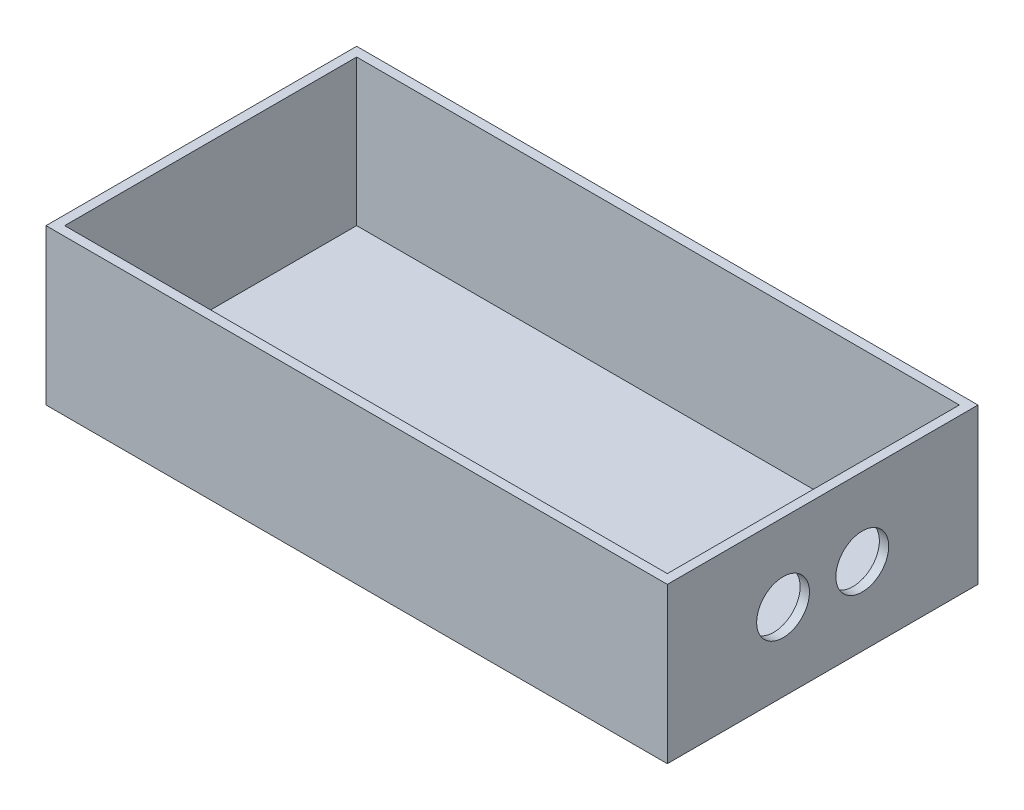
ISO-10303-21;
HEADER;
FILE_DESCRIPTION(('STEP AP214'),'2;1');
FILE_NAME('part.step','',(''),(''),'','','');
FILE_SCHEMA(('AUTOMOTIVE_DESIGN { 1 0 10303 214 1 1 1 1 }'));
ENDSEC;
DATA;
#1=APPLICATION_CONTEXT('core data for automotive mechanical design processes');
#2=APPLICATION_PROTOCOL_DEFINITION('international standard','automotive_design',2000,#1);
#3=PRODUCT_CONTEXT('',#1,'mechanical');
#4=PRODUCT('Part','Part','',(#3));
#5=PRODUCT_RELATED_PRODUCT_CATEGORY('part','',(#4));
#6=PRODUCT_DEFINITION_FORMATION('','',#4);
#7=PRODUCT_DEFINITION_CONTEXT('part definition',#1,'design');
#8=PRODUCT_DEFINITION('design','',#6,#7);
#9=PRODUCT_DEFINITION_SHAPE('','',#8);
#10=(LENGTH_UNIT() NAMED_UNIT(*) SI_UNIT(.MILLI.,.METRE.));
#11=(NAMED_UNIT(*) PLANE_ANGLE_UNIT() SI_UNIT($,.RADIAN.));
#12=(NAMED_UNIT(*) SI_UNIT($,.STERADIAN.) SOLID_ANGLE_UNIT());
#13=UNCERTAINTY_MEASURE_WITH_UNIT(LENGTH_MEASURE(1.E-05),#10,'distance_accuracy_value','');
#14=(GEOMETRIC_REPRESENTATION_CONTEXT(3) GLOBAL_UNCERTAINTY_ASSIGNED_CONTEXT((#13)) GLOBAL_UNIT_ASSIGNED_CONTEXT((#10,
#11,#12)) REPRESENTATION_CONTEXT('',''));
#15=CARTESIAN_POINT('',(0.,0.,0.));
#16=DIRECTION('',(0.,0.,1.));
#17=DIRECTION('',(1.,0.,0.));
#18=AXIS2_PLACEMENT_3D('',#15,#16,#17);
#19=CARTESIAN_POINT('',(-100.,25.,100.));
#20=DIRECTION('',(0.,-1.,0.));
#21=DIRECTION('',(0.,0.,-1.));
#22=AXIS2_PLACEMENT_3D('',#19,#20,#21);
#23=PLANE('',#22);
#24=DIRECTION('',(-1.,0.,0.));
#25=VECTOR('',#24,1.);
#26=CARTESIAN_POINT('',(-100.,25.,0.));
#27=LINE('',#26,#25);
#28=CARTESIAN_POINT('',(100.,25.,0.));
#29=VERTEX_POINT('',#28);
#30=CARTESIAN_POINT('',(-100.,25.,0.));
#31=VERTEX_POINT('',#30);
#32=EDGE_CURVE('E165',#29,#31,#27,.T.);
#33=ORIENTED_EDGE('',*,*,#32,.T.);
#34=DIRECTION('',(0.,0.,-1.));
#35=VECTOR('',#34,1.);
#36=CARTESIAN_POINT('',(-100.,25.,100.));
#37=LINE('',#36,#35);
#38=CARTESIAN_POINT('',(-100.,25.,100.));
#39=VERTEX_POINT('',#38);
#40=EDGE_CURVE('E45',#39,#31,#37,.T.);
#41=ORIENTED_EDGE('',*,*,#40,.F.);
#42=DIRECTION('',(-1.,0.,0.));
#43=VECTOR('',#42,1.);
#44=CARTESIAN_POINT('',(-100.,25.,100.));
#45=LINE('',#44,#43);
#46=CARTESIAN_POINT('',(100.,25.,100.));
#47=VERTEX_POINT('',#46);
#48=EDGE_CURVE('E89',#47,#39,#45,.T.);
#49=ORIENTED_EDGE('',*,*,#48,.F.);
#50=DIRECTION('',(0.,0.,-1.));
#51=VECTOR('',#50,1.);
#52=CARTESIAN_POINT('',(100.,25.,100.));
#53=LINE('',#52,#51);
#54=EDGE_CURVE('E11',#47,#29,#53,.T.);
#55=ORIENTED_EDGE('',*,*,#54,.T.);
#56=EDGE_LOOP('',(#33,#41,#49,#55));
#57=FACE_BOUND('',#56,.T.);
#58=DIRECTION('',(-1.,0.,0.));
#59=VECTOR('',#58,1.);
#60=CARTESIAN_POINT('',(0.,25.,3.));
#61=LINE('',#60,#59);
#62=CARTESIAN_POINT('',(97.,25.,3.));
#63=VERTEX_POINT('',#62);
#64=CARTESIAN_POINT('',(-97.,25.,3.));
#65=VERTEX_POINT('',#64);
#66=EDGE_CURVE('E133',#63,#65,#61,.T.);
#67=ORIENTED_EDGE('',*,*,#66,.F.);
#68=DIRECTION('',(0.,0.,-1.));
#69=VECTOR('',#68,1.);
#70=CARTESIAN_POINT('',(97.,25.,100.));
#71=LINE('',#70,#69);
#72=CARTESIAN_POINT('',(97.,25.,97.));
#73=VERTEX_POINT('',#72);
#74=EDGE_CURVE('E132',#73,#63,#71,.T.);
#75=ORIENTED_EDGE('',*,*,#74,.F.);
#76=DIRECTION('',(-1.,0.,0.));
#77=VECTOR('',#76,1.);
#78=CARTESIAN_POINT('',(0.,25.,97.));
#79=LINE('',#78,#77);
#80=CARTESIAN_POINT('',(-97.,25.,97.));
#81=VERTEX_POINT('',#80);
#82=EDGE_CURVE('E142',#73,#81,#79,.T.);
#83=ORIENTED_EDGE('',*,*,#82,.T.);
#84=DIRECTION('',(0.,0.,-1.));
#85=VECTOR('',#84,1.);
#86=CARTESIAN_POINT('',(-97.,25.,100.));
#87=LINE('',#86,#85);
#88=EDGE_CURVE('E147',#81,#65,#87,.T.);
#89=ORIENTED_EDGE('',*,*,#88,.T.);
#90=EDGE_LOOP('',(#67,#75,#83,#89));
#91=FACE_BOUND('',#90,.T.);
#92=ADVANCED_FACE('F37',(#57,#91),#23,.F.);
#93=CARTESIAN_POINT('',(100.,-25.,100.));
#94=DIRECTION('',(-1.,0.,0.));
#95=DIRECTION('',(0.,0.,1.));
#96=AXIS2_PLACEMENT_3D('',#93,#94,#95);
#97=PLANE('',#96);
#98=CARTESIAN_POINT('',(100.,0.,62.75));
#99=DIRECTION('',(-1.,0.,0.));
#100=DIRECTION('',(0.,0.,1.));
#101=AXIS2_PLACEMENT_3D('',#98,#99,#100);
#102=CIRCLE('',#101,8.50000000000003);
#103=CARTESIAN_POINT('',(100.,0.,71.25));
#104=VERTEX_POINT('',#103);
#105=EDGE_CURVE('E134',#104,#104,#102,.F.);
#106=ORIENTED_EDGE('',*,*,#105,.F.);
#107=EDGE_LOOP('',(#106));
#108=FACE_BOUND('',#107,.T.);
#109=CARTESIAN_POINT('',(100.,0.,37.25));
#110=DIRECTION('',(-1.,0.,0.));
#111=DIRECTION('',(0.,0.,1.));
#112=AXIS2_PLACEMENT_3D('',#109,#110,#111);
#113=CIRCLE('',#112,8.5);
#114=CARTESIAN_POINT('',(100.,0.,45.75));
#115=VERTEX_POINT('',#114);
#116=EDGE_CURVE('E138',#115,#115,#113,.F.);
#117=ORIENTED_EDGE('',*,*,#116,.F.);
#118=EDGE_LOOP('',(#117));
#119=FACE_BOUND('',#118,.T.);
#120=DIRECTION('',(0.,1.,0.));
#121=VECTOR('',#120,1.);
#122=CARTESIAN_POINT('',(100.,-25.,0.));
#123=LINE('',#122,#121);
#124=CARTESIAN_POINT('',(100.,-25.,0.));
#125=VERTEX_POINT('',#124);
#126=EDGE_CURVE('E150',#125,#29,#123,.T.);
#127=ORIENTED_EDGE('',*,*,#126,.T.);
#128=ORIENTED_EDGE('',*,*,#54,.F.);
#129=DIRECTION('',(0.,1.,0.));
#130=VECTOR('',#129,1.);
#131=CARTESIAN_POINT('',(100.,-25.,100.));
#132=LINE('',#131,#130);
#133=CARTESIAN_POINT('',(100.,-25.,100.));
#134=VERTEX_POINT('',#133);
#135=EDGE_CURVE('E156',#134,#47,#132,.T.);
#136=ORIENTED_EDGE('',*,*,#135,.F.);
#137=DIRECTION('',(0.,0.,-1.));
#138=VECTOR('',#137,1.);
#139=CARTESIAN_POINT('',(100.,-25.,100.));
#140=LINE('',#139,#138);
#141=EDGE_CURVE('E162',#134,#125,#140,.T.);
#142=ORIENTED_EDGE('',*,*,#141,.T.);
#143=EDGE_LOOP('',(#127,#128,#136,#142));
#144=FACE_BOUND('',#143,.T.);
#145=ADVANCED_FACE('F39',(#108,#119,#144),#97,.F.);
#146=CARTESIAN_POINT('',(-100.,-25.,100.));
#147=DIRECTION('',(1.,0.,0.));
#148=DIRECTION('',(0.,0.,-1.));
#149=AXIS2_PLACEMENT_3D('',#146,#147,#148);
#150=PLANE('',#149);
#151=DIRECTION('',(0.,-1.,0.));
#152=VECTOR('',#151,1.);
#153=CARTESIAN_POINT('',(-100.,-25.,0.));
#154=LINE('',#153,#152);
#155=CARTESIAN_POINT('',(-100.,-25.,0.));
#156=VERTEX_POINT('',#155);
#157=EDGE_CURVE('E167',#31,#156,#154,.T.);
#158=ORIENTED_EDGE('',*,*,#157,.T.);
#159=DIRECTION('',(0.,0.,-1.));
#160=VECTOR('',#159,1.);
#161=CARTESIAN_POINT('',(-100.,-25.,100.));
#162=LINE('',#161,#160);
#163=CARTESIAN_POINT('',(-100.,-25.,100.));
#164=VERTEX_POINT('',#163);
#165=EDGE_CURVE('E171',#164,#156,#162,.T.);
#166=ORIENTED_EDGE('',*,*,#165,.F.);
#167=DIRECTION('',(0.,-1.,0.));
#168=VECTOR('',#167,1.);
#169=CARTESIAN_POINT('',(-100.,-25.,100.));
#170=LINE('',#169,#168);
#171=EDGE_CURVE('E159',#39,#164,#170,.T.);
#172=ORIENTED_EDGE('',*,*,#171,.F.);
#173=ORIENTED_EDGE('',*,*,#40,.T.);
#174=EDGE_LOOP('',(#158,#166,#172,#173));
#175=FACE_BOUND('',#174,.T.);
#176=ADVANCED_FACE('F176',(#175),#150,.F.);
#177=CARTESIAN_POINT('',(-100.,-25.,100.));
#178=DIRECTION('',(0.,1.,0.));
#179=DIRECTION('',(0.,0.,1.));
#180=AXIS2_PLACEMENT_3D('',#177,#178,#179);
#181=PLANE('',#180);
#182=DIRECTION('',(1.,0.,0.));
#183=VECTOR('',#182,1.);
#184=CARTESIAN_POINT('',(-100.,-25.,0.));
#185=LINE('',#184,#183);
#186=EDGE_CURVE('E82',#156,#125,#185,.T.);
#187=ORIENTED_EDGE('',*,*,#186,.T.);
#188=ORIENTED_EDGE('',*,*,#141,.F.);
#189=DIRECTION('',(1.,0.,0.));
#190=VECTOR('',#189,1.);
#191=CARTESIAN_POINT('',(-100.,-25.,100.));
#192=LINE('',#191,#190);
#193=EDGE_CURVE('E61',#164,#134,#192,.T.);
#194=ORIENTED_EDGE('',*,*,#193,.F.);
#195=ORIENTED_EDGE('',*,*,#165,.T.);
#196=EDGE_LOOP('',(#187,#188,#194,#195));
#197=FACE_BOUND('',#196,.T.);
#198=ADVANCED_FACE('F184',(#197),#181,.F.);
#199=CARTESIAN_POINT('',(0.,0.,100.));
#200=DIRECTION('',(0.,0.,-1.));
#201=DIRECTION('',(-1.,0.,0.));
#202=AXIS2_PLACEMENT_3D('',#199,#200,#201);
#203=PLANE('',#202);
#204=ORIENTED_EDGE('',*,*,#135,.T.);
#205=ORIENTED_EDGE('',*,*,#48,.T.);
#206=ORIENTED_EDGE('',*,*,#171,.T.);
#207=ORIENTED_EDGE('',*,*,#193,.T.);
#208=EDGE_LOOP('',(#204,#205,#206,#207));
#209=FACE_BOUND('',#208,.T.);
#210=ADVANCED_FACE('F186',(#209),#203,.F.);
#211=CARTESIAN_POINT('',(0.,0.,0.));
#212=DIRECTION('',(0.,0.,-1.));
#213=DIRECTION('',(-1.,0.,0.));
#214=AXIS2_PLACEMENT_3D('',#211,#212,#213);
#215=PLANE('',#214);
#216=ORIENTED_EDGE('',*,*,#126,.F.);
#217=ORIENTED_EDGE('',*,*,#186,.F.);
#218=ORIENTED_EDGE('',*,*,#157,.F.);
#219=ORIENTED_EDGE('',*,*,#32,.F.);
#220=EDGE_LOOP('',(#216,#217,#218,#219));
#221=FACE_BOUND('',#220,.T.);
#222=ADVANCED_FACE('F180',(#221),#215,.T.);
#223=CARTESIAN_POINT('',(97.,-25.,100.));
#224=DIRECTION('',(-1.,0.,0.));
#225=DIRECTION('',(0.,0.,1.));
#226=AXIS2_PLACEMENT_3D('',#223,#224,#225);
#227=PLANE('',#226);
#228=CARTESIAN_POINT('',(97.,0.,62.75));
#229=DIRECTION('',(1.,0.,0.));
#230=DIRECTION('',(0.,0.,-1.));
#231=AXIS2_PLACEMENT_3D('',#228,#229,#230);
#232=CIRCLE('',#231,8.50000000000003);
#233=CARTESIAN_POINT('',(97.,0.,71.25));
#234=VERTEX_POINT('',#233);
#235=EDGE_CURVE('E238',#234,#234,#232,.T.);
#236=ORIENTED_EDGE('',*,*,#235,.T.);
#237=EDGE_LOOP('',(#236));
#238=FACE_BOUND('',#237,.T.);
#239=CARTESIAN_POINT('',(97.,0.,37.25));
#240=DIRECTION('',(1.,0.,0.));
#241=DIRECTION('',(0.,0.,-1.));
#242=AXIS2_PLACEMENT_3D('',#239,#240,#241);
#243=CIRCLE('',#242,8.5);
#244=CARTESIAN_POINT('',(97.,0.,45.75));
#245=VERTEX_POINT('',#244);
#246=EDGE_CURVE('E244',#245,#245,#243,.T.);
#247=ORIENTED_EDGE('',*,*,#246,.T.);
#248=EDGE_LOOP('',(#247));
#249=FACE_BOUND('',#248,.T.);
#250=DIRECTION('',(0.,1.,0.));
#251=VECTOR('',#250,1.);
#252=CARTESIAN_POINT('',(97.,0.,3.));
#253=LINE('',#252,#251);
#254=CARTESIAN_POINT('',(97.,-22.,3.));
#255=VERTEX_POINT('',#254);
#256=EDGE_CURVE('E116',#255,#63,#253,.T.);
#257=ORIENTED_EDGE('',*,*,#256,.F.);
#258=DIRECTION('',(0.,0.,-1.));
#259=VECTOR('',#258,1.);
#260=CARTESIAN_POINT('',(97.,-22.,100.));
#261=LINE('',#260,#259);
#262=CARTESIAN_POINT('',(97.,-22.,97.));
#263=VERTEX_POINT('',#262);
#264=EDGE_CURVE('E124',#263,#255,#261,.T.);
#265=ORIENTED_EDGE('',*,*,#264,.F.);
#266=DIRECTION('',(0.,1.,0.));
#267=VECTOR('',#266,1.);
#268=CARTESIAN_POINT('',(97.,0.,97.));
#269=LINE('',#268,#267);
#270=EDGE_CURVE('E52',#263,#73,#269,.T.);
#271=ORIENTED_EDGE('',*,*,#270,.T.);
#272=ORIENTED_EDGE('',*,*,#74,.T.);
#273=EDGE_LOOP('',(#257,#265,#271,#272));
#274=FACE_BOUND('',#273,.T.);
#275=ADVANCED_FACE('F130',(#238,#249,#274),#227,.T.);
#276=CARTESIAN_POINT('',(-97.,-25.,100.));
#277=DIRECTION('',(1.,0.,0.));
#278=DIRECTION('',(0.,0.,-1.));
#279=AXIS2_PLACEMENT_3D('',#276,#277,#278);
#280=PLANE('',#279);
#281=DIRECTION('',(0.,-1.,0.));
#282=VECTOR('',#281,1.);
#283=CARTESIAN_POINT('',(-97.,0.,3.));
#284=LINE('',#283,#282);
#285=CARTESIAN_POINT('',(-97.,-22.,3.));
#286=VERTEX_POINT('',#285);
#287=EDGE_CURVE('E119',#65,#286,#284,.T.);
#288=ORIENTED_EDGE('',*,*,#287,.F.);
#289=ORIENTED_EDGE('',*,*,#88,.F.);
#290=DIRECTION('',(0.,-1.,0.));
#291=VECTOR('',#290,1.);
#292=CARTESIAN_POINT('',(-97.,0.,97.));
#293=LINE('',#292,#291);
#294=CARTESIAN_POINT('',(-97.,-22.,97.));
#295=VERTEX_POINT('',#294);
#296=EDGE_CURVE('E145',#81,#295,#293,.T.);
#297=ORIENTED_EDGE('',*,*,#296,.T.);
#298=DIRECTION('',(0.,0.,-1.));
#299=VECTOR('',#298,1.);
#300=CARTESIAN_POINT('',(-97.,-22.,100.));
#301=LINE('',#300,#299);
#302=EDGE_CURVE('E128',#295,#286,#301,.T.);
#303=ORIENTED_EDGE('',*,*,#302,.T.);
#304=EDGE_LOOP('',(#288,#289,#297,#303));
#305=FACE_BOUND('',#304,.T.);
#306=ADVANCED_FACE('F202',(#305),#280,.T.);
#307=CARTESIAN_POINT('',(-100.,-22.,100.));
#308=DIRECTION('',(0.,1.,0.));
#309=DIRECTION('',(0.,0.,1.));
#310=AXIS2_PLACEMENT_3D('',#307,#308,#309);
#311=PLANE('',#310);
#312=DIRECTION('',(1.,0.,0.));
#313=VECTOR('',#312,1.);
#314=CARTESIAN_POINT('',(0.,-22.,3.));
#315=LINE('',#314,#313);
#316=EDGE_CURVE('E112',#286,#255,#315,.T.);
#317=ORIENTED_EDGE('',*,*,#316,.F.);
#318=ORIENTED_EDGE('',*,*,#302,.F.);
#319=DIRECTION('',(1.,0.,0.));
#320=VECTOR('',#319,1.);
#321=CARTESIAN_POINT('',(0.,-22.,97.));
#322=LINE('',#321,#320);
#323=EDGE_CURVE('E127',#295,#263,#322,.T.);
#324=ORIENTED_EDGE('',*,*,#323,.T.);
#325=ORIENTED_EDGE('',*,*,#264,.T.);
#326=EDGE_LOOP('',(#317,#318,#324,#325));
#327=FACE_BOUND('',#326,.T.);
#328=ADVANCED_FACE('F125',(#327),#311,.T.);
#329=CARTESIAN_POINT('',(0.,0.,97.));
#330=DIRECTION('',(0.,0.,-1.));
#331=DIRECTION('',(-1.,0.,0.));
#332=AXIS2_PLACEMENT_3D('',#329,#330,#331);
#333=PLANE('',#332);
#334=ORIENTED_EDGE('',*,*,#270,.F.);
#335=ORIENTED_EDGE('',*,*,#323,.F.);
#336=ORIENTED_EDGE('',*,*,#296,.F.);
#337=ORIENTED_EDGE('',*,*,#82,.F.);
#338=EDGE_LOOP('',(#334,#335,#336,#337));
#339=FACE_BOUND('',#338,.T.);
#340=ADVANCED_FACE('F205',(#339),#333,.T.);
#341=CARTESIAN_POINT('',(0.,0.,3.));
#342=DIRECTION('',(0.,0.,-1.));
#343=DIRECTION('',(-1.,0.,0.));
#344=AXIS2_PLACEMENT_3D('',#341,#342,#343);
#345=PLANE('',#344);
#346=ORIENTED_EDGE('',*,*,#256,.T.);
#347=ORIENTED_EDGE('',*,*,#66,.T.);
#348=ORIENTED_EDGE('',*,*,#287,.T.);
#349=ORIENTED_EDGE('',*,*,#316,.T.);
#350=EDGE_LOOP('',(#346,#347,#348,#349));
#351=FACE_BOUND('',#350,.T.);
#352=ADVANCED_FACE('F114',(#351),#345,.F.);
#353=CARTESIAN_POINT('',(100.000012,0.,37.25));
#354=DIRECTION('',(-1.,0.,0.));
#355=DIRECTION('',(0.,0.,1.));
#356=AXIS2_PLACEMENT_3D('',#353,#354,#355);
#357=CYLINDRICAL_SURFACE('',#356,8.5);
#358=CARTESIAN_POINT('',(97.,0.,45.75));
#359=CARTESIAN_POINT('',(97.03125,0.,45.75));
#360=CARTESIAN_POINT('',(97.0625,0.,45.75));
#361=CARTESIAN_POINT('',(97.125,0.,45.75));
#362=CARTESIAN_POINT('',(97.15625,0.,45.75));
#363=CARTESIAN_POINT('',(97.21875,0.,45.75));
#364=CARTESIAN_POINT('',(97.25,0.,45.75));
#365=CARTESIAN_POINT('',(97.3125,0.,45.75));
#366=CARTESIAN_POINT('',(97.34375,0.,45.75));
#367=CARTESIAN_POINT('',(97.40625,0.,45.75));
#368=CARTESIAN_POINT('',(97.4375,0.,45.75));
#369=CARTESIAN_POINT('',(97.5,0.,45.75));
#370=CARTESIAN_POINT('',(97.53125,0.,45.75));
#371=CARTESIAN_POINT('',(97.59375,0.,45.75));
#372=CARTESIAN_POINT('',(97.625,0.,45.75));
#373=CARTESIAN_POINT('',(97.6875,0.,45.75));
#374=CARTESIAN_POINT('',(97.71875,0.,45.75));
#375=CARTESIAN_POINT('',(97.78125,0.,45.75));
#376=CARTESIAN_POINT('',(97.8125,0.,45.75));
#377=CARTESIAN_POINT('',(97.875,0.,45.75));
#378=CARTESIAN_POINT('',(97.90625,0.,45.75));
#379=CARTESIAN_POINT('',(97.96875,0.,45.75));
#380=CARTESIAN_POINT('',(98.,0.,45.75));
#381=CARTESIAN_POINT('',(98.0625,0.,45.75));
#382=CARTESIAN_POINT('',(98.09375,0.,45.75));
#383=CARTESIAN_POINT('',(98.15625,0.,45.75));
#384=CARTESIAN_POINT('',(98.1875,0.,45.75));
#385=CARTESIAN_POINT('',(98.25,0.,45.75));
#386=CARTESIAN_POINT('',(98.28125,0.,45.75));
#387=CARTESIAN_POINT('',(98.34375,0.,45.75));
#388=CARTESIAN_POINT('',(98.375,0.,45.75));
#389=CARTESIAN_POINT('',(98.4375,0.,45.75));
#390=CARTESIAN_POINT('',(98.46875,0.,45.75));
#391=CARTESIAN_POINT('',(98.53125,0.,45.75));
#392=CARTESIAN_POINT('',(98.5625,0.,45.75));
#393=CARTESIAN_POINT('',(98.625,0.,45.75));
#394=CARTESIAN_POINT('',(98.65625,0.,45.75));
#395=CARTESIAN_POINT('',(98.71875,0.,45.75));
#396=CARTESIAN_POINT('',(98.75,0.,45.75));
#397=CARTESIAN_POINT('',(98.8125,0.,45.75));
#398=CARTESIAN_POINT('',(98.84375,0.,45.75));
#399=CARTESIAN_POINT('',(98.90625,0.,45.75));
#400=CARTESIAN_POINT('',(98.9375,0.,45.75));
#401=CARTESIAN_POINT('',(99.,0.,45.75));
#402=CARTESIAN_POINT('',(99.03125,0.,45.75));
#403=CARTESIAN_POINT('',(99.09375,0.,45.75));
#404=CARTESIAN_POINT('',(99.125,0.,45.75));
#405=CARTESIAN_POINT('',(99.1875,0.,45.75));
#406=CARTESIAN_POINT('',(99.21875,0.,45.75));
#407=CARTESIAN_POINT('',(99.28125,0.,45.75));
#408=CARTESIAN_POINT('',(99.3125,0.,45.75));
#409=CARTESIAN_POINT('',(99.375,0.,45.75));
#410=CARTESIAN_POINT('',(99.40625,0.,45.75));
#411=CARTESIAN_POINT('',(99.46875,0.,45.75));
#412=CARTESIAN_POINT('',(99.5,0.,45.75));
#413=CARTESIAN_POINT('',(99.5625,0.,45.75));
#414=CARTESIAN_POINT('',(99.59375,0.,45.75));
#415=CARTESIAN_POINT('',(99.65625,0.,45.75));
#416=CARTESIAN_POINT('',(99.6875,0.,45.75));
#417=CARTESIAN_POINT('',(99.75,0.,45.75));
#418=CARTESIAN_POINT('',(99.78125,0.,45.75));
#419=CARTESIAN_POINT('',(99.84375,0.,45.75));
#420=CARTESIAN_POINT('',(99.875,0.,45.75));
#421=CARTESIAN_POINT('',(99.9375,0.,45.75));
#422=CARTESIAN_POINT('',(99.96875,0.,45.75));
#423=CARTESIAN_POINT('',(100.,0.,45.75));
#424=B_SPLINE_CURVE_WITH_KNOTS('',3,(#358,#359,#360,#361,#362,#363,#364,#365,#366,#367,#368,
#369,#370,#371,#372,#373,#374,#375,#376,#377,#378,#379,#380,#381,#382,#383,#384,#385,#386,#387,
#388,#389,#390,#391,#392,#393,#394,#395,#396,#397,#398,#399,#400,#401,#402,#403,#404,#405,#406,
#407,#408,#409,#410,#411,#412,#413,#414,#415,#416,#417,#418,#419,#420,#421,#422,#423),
.UNSPECIFIED.,.F.,.F.,(4,2,2,2,2,2,2,2,2,2,2,2,2,2,2,2,2,2,2,2,2,2,2,2,2,2,2,2,2,2,2,2,4),(0.,
0.0937500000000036,0.187500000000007,0.281250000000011,0.375000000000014,0.468750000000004,
0.562500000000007,0.656250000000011,0.750000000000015,0.843750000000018,0.937500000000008,
1.03125000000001,1.12500000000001,1.21875000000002,1.31250000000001,1.40625000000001,
1.50000000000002,1.59375000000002,1.68750000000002,1.78125000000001,1.87500000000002,
1.96875000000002,2.06250000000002,2.15625000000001,2.25000000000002,2.34375000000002,
2.43750000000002,2.53125000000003,2.62500000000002,2.71875000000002,2.81250000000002,
2.90625000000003,3.00000000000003),.UNSPECIFIED.);
#425=EDGE_CURVE('BSEAM212',#245,#115,#424,.T.);
#426=ORIENTED_EDGE('',*,*,#246,.F.);
#427=ORIENTED_EDGE('',*,*,#116,.T.);
#428=ORIENTED_EDGE('',*,*,#425,.T.);
#429=ORIENTED_EDGE('',*,*,#425,.F.);
#430=EDGE_LOOP('',(#426,#428,#427,#429));
#431=FACE_BOUND('',#430,.T.);
#432=ADVANCED_FACE('F212',(#431),#357,.F.);
#433=CARTESIAN_POINT('',(100.000012,0.,62.75));
#434=DIRECTION('',(-1.,0.,0.));
#435=DIRECTION('',(0.,0.,1.));
#436=AXIS2_PLACEMENT_3D('',#433,#434,#435);
#437=CYLINDRICAL_SURFACE('',#436,8.50000000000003);
#438=CARTESIAN_POINT('',(97.,0.,71.25));
#439=CARTESIAN_POINT('',(97.03125,0.,71.25));
#440=CARTESIAN_POINT('',(97.0625,0.,71.25));
#441=CARTESIAN_POINT('',(97.125,0.,71.25));
#442=CARTESIAN_POINT('',(97.15625,0.,71.25));
#443=CARTESIAN_POINT('',(97.21875,0.,71.25));
#444=CARTESIAN_POINT('',(97.25,0.,71.25));
#445=CARTESIAN_POINT('',(97.3125,0.,71.25));
#446=CARTESIAN_POINT('',(97.34375,0.,71.25));
#447=CARTESIAN_POINT('',(97.40625,0.,71.25));
#448=CARTESIAN_POINT('',(97.4375,0.,71.25));
#449=CARTESIAN_POINT('',(97.5,0.,71.25));
#450=CARTESIAN_POINT('',(97.53125,0.,71.25));
#451=CARTESIAN_POINT('',(97.59375,0.,71.25));
#452=CARTESIAN_POINT('',(97.625,0.,71.25));
#453=CARTESIAN_POINT('',(97.6875,0.,71.25));
#454=CARTESIAN_POINT('',(97.71875,0.,71.25));
#455=CARTESIAN_POINT('',(97.78125,0.,71.25));
#456=CARTESIAN_POINT('',(97.8125,0.,71.25));
#457=CARTESIAN_POINT('',(97.875,0.,71.25));
#458=CARTESIAN_POINT('',(97.90625,0.,71.25));
#459=CARTESIAN_POINT('',(97.96875,0.,71.25));
#460=CARTESIAN_POINT('',(98.,0.,71.25));
#461=CARTESIAN_POINT('',(98.0625,0.,71.25));
#462=CARTESIAN_POINT('',(98.09375,0.,71.25));
#463=CARTESIAN_POINT('',(98.15625,0.,71.25));
#464=CARTESIAN_POINT('',(98.1875,0.,71.25));
#465=CARTESIAN_POINT('',(98.25,0.,71.25));
#466=CARTESIAN_POINT('',(98.28125,0.,71.25));
#467=CARTESIAN_POINT('',(98.34375,0.,71.25));
#468=CARTESIAN_POINT('',(98.375,0.,71.25));
#469=CARTESIAN_POINT('',(98.4375,0.,71.25));
#470=CARTESIAN_POINT('',(98.46875,0.,71.25));
#471=CARTESIAN_POINT('',(98.53125,0.,71.25));
#472=CARTESIAN_POINT('',(98.5625,0.,71.25));
#473=CARTESIAN_POINT('',(98.625,0.,71.25));
#474=CARTESIAN_POINT('',(98.65625,0.,71.25));
#475=CARTESIAN_POINT('',(98.71875,0.,71.25));
#476=CARTESIAN_POINT('',(98.75,0.,71.25));
#477=CARTESIAN_POINT('',(98.8125,0.,71.25));
#478=CARTESIAN_POINT('',(98.84375,0.,71.25));
#479=CARTESIAN_POINT('',(98.90625,0.,71.25));
#480=CARTESIAN_POINT('',(98.9375,0.,71.25));
#481=CARTESIAN_POINT('',(99.,0.,71.25));
#482=CARTESIAN_POINT('',(99.03125,0.,71.25));
#483=CARTESIAN_POINT('',(99.09375,0.,71.25));
#484=CARTESIAN_POINT('',(99.125,0.,71.25));
#485=CARTESIAN_POINT('',(99.1875,0.,71.25));
#486=CARTESIAN_POINT('',(99.21875,0.,71.25));
#487=CARTESIAN_POINT('',(99.28125,0.,71.25));
#488=CARTESIAN_POINT('',(99.3125,0.,71.25));
#489=CARTESIAN_POINT('',(99.375,0.,71.25));
#490=CARTESIAN_POINT('',(99.40625,0.,71.25));
#491=CARTESIAN_POINT('',(99.46875,0.,71.25));
#492=CARTESIAN_POINT('',(99.5,0.,71.25));
#493=CARTESIAN_POINT('',(99.5625,0.,71.25));
#494=CARTESIAN_POINT('',(99.59375,0.,71.25));
#495=CARTESIAN_POINT('',(99.65625,0.,71.25));
#496=CARTESIAN_POINT('',(99.6875,0.,71.25));
#497=CARTESIAN_POINT('',(99.75,0.,71.25));
#498=CARTESIAN_POINT('',(99.78125,0.,71.25));
#499=CARTESIAN_POINT('',(99.84375,0.,71.25));
#500=CARTESIAN_POINT('',(99.875,0.,71.25));
#501=CARTESIAN_POINT('',(99.9375,0.,71.25));
#502=CARTESIAN_POINT('',(99.96875,0.,71.25));
#503=CARTESIAN_POINT('',(100.,0.,71.25));
#504=B_SPLINE_CURVE_WITH_KNOTS('',3,(#438,#439,#440,#441,#442,#443,#444,#445,#446,#447,#448,
#449,#450,#451,#452,#453,#454,#455,#456,#457,#458,#459,#460,#461,#462,#463,#464,#465,#466,#467,
#468,#469,#470,#471,#472,#473,#474,#475,#476,#477,#478,#479,#480,#481,#482,#483,#484,#485,#486,
#487,#488,#489,#490,#491,#492,#493,#494,#495,#496,#497,#498,#499,#500,#501,#502,#503),
.UNSPECIFIED.,.F.,.F.,(4,2,2,2,2,2,2,2,2,2,2,2,2,2,2,2,2,2,2,2,2,2,2,2,2,2,2,2,2,2,2,2,4),(0.,
0.0937500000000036,0.187500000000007,0.281250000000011,0.375000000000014,0.468750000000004,
0.562500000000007,0.656250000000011,0.750000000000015,0.843750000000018,0.937500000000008,
1.03125000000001,1.12500000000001,1.21875000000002,1.31250000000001,1.40625000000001,
1.50000000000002,1.59375000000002,1.68750000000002,1.78125000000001,1.87500000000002,
1.96875000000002,2.06250000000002,2.15625000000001,2.25000000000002,2.34375000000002,
2.43750000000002,2.53125000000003,2.62500000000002,2.71875000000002,2.81250000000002,
2.90625000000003,3.00000000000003),.UNSPECIFIED.);
#505=EDGE_CURVE('BSEAM230',#234,#104,#504,.T.);
#506=ORIENTED_EDGE('',*,*,#235,.F.);
#507=ORIENTED_EDGE('',*,*,#105,.T.);
#508=ORIENTED_EDGE('',*,*,#505,.T.);
#509=ORIENTED_EDGE('',*,*,#505,.F.);
#510=EDGE_LOOP('',(#506,#508,#507,#509));
#511=FACE_BOUND('',#510,.T.);
#512=ADVANCED_FACE('F230',(#511),#437,.F.);
#513=CLOSED_SHELL('',(#92,#145,#176,#198,#210,#222,#275,#306,#328,#340,#352,#432,#512));
#514=MANIFOLD_SOLID_BREP('B2',#513);
#515=ADVANCED_BREP_SHAPE_REPRESENTATION('',(#18,#514),#14);
#516=SHAPE_DEFINITION_REPRESENTATION(#9,#515);
ENDSEC;
END-ISO-10303-21;
